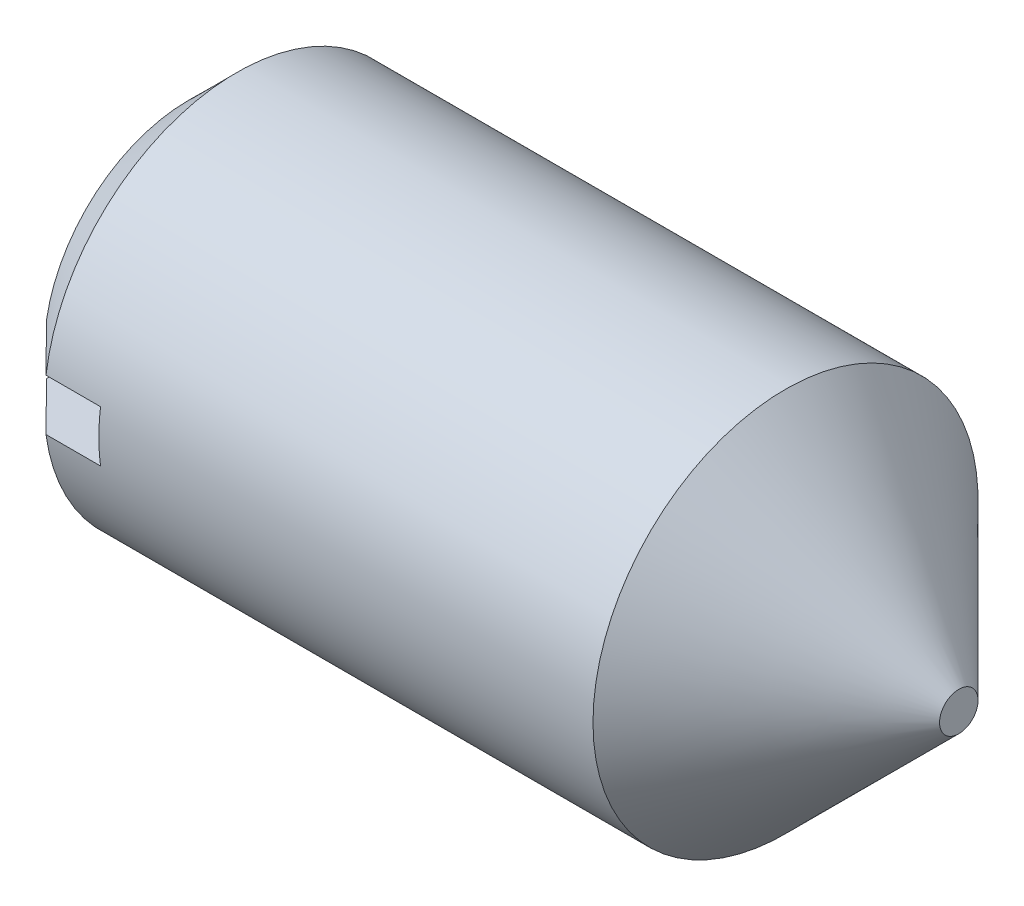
ISO-10303-21;
HEADER;
FILE_DESCRIPTION(('STEP AP214'),'2;1');
FILE_NAME('part.step','',(''),(''),'','','');
FILE_SCHEMA(('AUTOMOTIVE_DESIGN { 1 0 10303 214 1 1 1 1 }'));
ENDSEC;
DATA;
#1=APPLICATION_CONTEXT('core data for automotive mechanical design processes');
#2=APPLICATION_PROTOCOL_DEFINITION('international standard','automotive_design',2000,#1);
#3=PRODUCT_CONTEXT('',#1,'mechanical');
#4=PRODUCT('Part','Part','',(#3));
#5=PRODUCT_RELATED_PRODUCT_CATEGORY('part','',(#4));
#6=PRODUCT_DEFINITION_FORMATION('','',#4);
#7=PRODUCT_DEFINITION_CONTEXT('part definition',#1,'design');
#8=PRODUCT_DEFINITION('design','',#6,#7);
#9=PRODUCT_DEFINITION_SHAPE('','',#8);
#10=(LENGTH_UNIT() NAMED_UNIT(*) SI_UNIT(.MILLI.,.METRE.));
#11=(NAMED_UNIT(*) PLANE_ANGLE_UNIT() SI_UNIT($,.RADIAN.));
#12=(NAMED_UNIT(*) SI_UNIT($,.STERADIAN.) SOLID_ANGLE_UNIT());
#13=UNCERTAINTY_MEASURE_WITH_UNIT(LENGTH_MEASURE(1.E-05),#10,'distance_accuracy_value','');
#14=(GEOMETRIC_REPRESENTATION_CONTEXT(3) GLOBAL_UNCERTAINTY_ASSIGNED_CONTEXT((#13)) GLOBAL_UNIT_ASSIGNED_CONTEXT((#10,
#11,#12)) REPRESENTATION_CONTEXT('',''));
#15=CARTESIAN_POINT('',(0.,0.,0.));
#16=DIRECTION('',(0.,0.,1.));
#17=DIRECTION('',(1.,0.,0.));
#18=AXIS2_PLACEMENT_3D('',#15,#16,#17);
#19=CARTESIAN_POINT('',(0.,1.125,0.));
#20=DIRECTION('',(1.,0.,0.));
#21=DIRECTION('',(0.,0.,-1.));
#22=AXIS2_PLACEMENT_3D('',#19,#20,#21);
#23=PLANE('',#22);
#24=CARTESIAN_POINT('',(0.,0.,0.));
#25=DIRECTION('',(-1.,0.,0.));
#26=DIRECTION('',(0.,0.,1.));
#27=AXIS2_PLACEMENT_3D('',#24,#25,#26);
#28=CIRCLE('',#27,1.125);
#29=CARTESIAN_POINT('',(0.,0.2,1.10707949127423));
#30=VERTEX_POINT('',#29);
#31=CARTESIAN_POINT('',(0.,0.2,-1.10707949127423));
#32=VERTEX_POINT('',#31);
#33=EDGE_CURVE('E120',#30,#32,#28,.T.);
#34=ORIENTED_EDGE('',*,*,#33,.T.);
#35=DIRECTION('',(0.,0.,1.));
#36=VECTOR('',#35,1.);
#37=CARTESIAN_POINT('',(0.,0.2,-1.5));
#38=LINE('',#37,#36);
#39=EDGE_CURVE('E107',#32,#30,#38,.T.);
#40=ORIENTED_EDGE('',*,*,#39,.T.);
#41=EDGE_LOOP('',(#34,#40));
#42=FACE_BOUND('',#41,.T.);
#43=ADVANCED_FACE('F37',(#42),#23,.F.);
#44=CARTESIAN_POINT('',(0.375000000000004,0.,0.));
#45=DIRECTION('',(1.,0.,0.));
#46=DIRECTION('',(0.,0.,-1.));
#47=AXIS2_PLACEMENT_3D('',#44,#45,#46);
#48=CONICAL_SURFACE('',#47,1.5,0.785398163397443);
#49=CARTESIAN_POINT('',(0.375000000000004,0.,0.));
#50=DIRECTION('',(-1.,0.,0.));
#51=DIRECTION('',(0.,0.,1.));
#52=AXIS2_PLACEMENT_3D('',#49,#50,#51);
#53=CIRCLE('',#52,1.5);
#54=CARTESIAN_POINT('',(0.375000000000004,0.2,1.48660687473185));
#55=VERTEX_POINT('',#54);
#56=CARTESIAN_POINT('',(0.375000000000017,0.2,-1.48660687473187));
#57=VERTEX_POINT('',#56);
#58=EDGE_CURVE('E125',#55,#57,#53,.T.);
#59=ORIENTED_EDGE('',*,*,#58,.T.);
#60=CARTESIAN_POINT('',(2.18920799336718,0.2,-3.30816786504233));
#61=CARTESIAN_POINT('',(2.07649366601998,0.2,-3.19524610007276));
#62=CARTESIAN_POINT('',(1.96378832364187,0.2,-3.0823153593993));
#63=CARTESIAN_POINT('',(1.73840550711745,0.2,-2.85642283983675));
#64=CARTESIAN_POINT('',(1.62572803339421,0.2,-2.74346106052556));
#65=CARTESIAN_POINT('',(1.40037767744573,0.2,-2.51746010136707));
#66=CARTESIAN_POINT('',(1.28770480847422,0.2,-2.40442090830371));
#67=CARTESIAN_POINT('',(1.06242244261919,0.2,-2.17828252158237));
#68=CARTESIAN_POINT('',(0.949812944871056,0.2,-2.06518332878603));
#69=CARTESIAN_POINT('',(0.721578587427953,0.2,-1.83575394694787));
#70=CARTESIAN_POINT('',(0.605956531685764,0.2,-1.71942096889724));
#71=CARTESIAN_POINT('',(0.374890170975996,0.2,-1.48656880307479));
#72=CARTESIAN_POINT('',(0.259445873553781,0.2,-1.3700496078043));
#73=CARTESIAN_POINT('',(0.0865825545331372,0.2,-1.19499523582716));
#74=CARTESIAN_POINT('',(0.0290178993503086,0.2,-1.13660389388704));
#75=CARTESIAN_POINT('',(-0.0859582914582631,0.2,-1.01966845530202));
#76=CARTESIAN_POINT('',(-0.143369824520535,0.2,-0.96112435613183));
#77=CARTESIAN_POINT('',(-0.257927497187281,0.2,-0.843786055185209));
#78=CARTESIAN_POINT('',(-0.315073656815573,0.2,-0.784991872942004));
#79=CARTESIAN_POINT('',(-0.428894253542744,0.2,-0.666949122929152));
#80=CARTESIAN_POINT('',(-0.485568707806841,0.2,-0.607700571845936));
#81=CARTESIAN_POINT('',(-0.556834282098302,0.2,-0.531827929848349));
#82=CARTESIAN_POINT('',(-0.571929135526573,0.2,-0.515678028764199));
#83=CARTESIAN_POINT('',(-0.602008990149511,0.2,-0.483276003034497));
#84=CARTESIAN_POINT('',(-0.616993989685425,0.2,-0.467023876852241));
#85=CARTESIAN_POINT('',(-0.661668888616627,0.2,-0.418156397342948));
#86=CARTESIAN_POINT('',(-0.691153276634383,0.2,-0.385351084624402));
#87=CARTESIAN_POINT('',(-0.738520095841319,0.2,-0.330870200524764));
#88=CARTESIAN_POINT('',(-0.756726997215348,0.2,-0.309479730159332));
#89=CARTESIAN_POINT('',(-0.792449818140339,0.2,-0.26597934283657));
#90=CARTESIAN_POINT('',(-0.809962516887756,0.2,-0.243866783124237));
#91=CARTESIAN_POINT('',(-0.843767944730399,0.2,-0.198329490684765));
#92=CARTESIAN_POINT('',(-0.860046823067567,0.2,-0.174893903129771));
#93=CARTESIAN_POINT('',(-0.882018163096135,0.2,-0.138316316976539));
#94=CARTESIAN_POINT('',(-0.888920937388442,0.2,-0.125916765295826));
#95=CARTESIAN_POINT('',(-0.901444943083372,0.2,-0.100497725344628));
#96=CARTESIAN_POINT('',(-0.907068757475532,0.2,-0.0874795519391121));
#97=CARTESIAN_POINT('',(-0.916365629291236,0.2,-0.060703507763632));
#98=CARTESIAN_POINT('',(-0.92003589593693,0.2,-0.0469446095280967));
#99=CARTESIAN_POINT('',(-0.924561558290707,0.2,-0.0190194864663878));
#100=CARTESIAN_POINT('',(-0.925434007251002,0.2,-0.00485626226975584));
#101=CARTESIAN_POINT('',(-0.924139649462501,0.2,0.0233294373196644));
#102=CARTESIAN_POINT('',(-0.921970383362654,0.2,0.0373517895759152));
#103=CARTESIAN_POINT('',(-0.915181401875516,0.2,0.0648425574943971));
#104=CARTESIAN_POINT('',(-0.910545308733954,0.2,0.0783066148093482));
#105=CARTESIAN_POINT('',(-0.898239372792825,0.2,0.107921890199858));
#106=CARTESIAN_POINT('',(-0.890094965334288,0.2,0.123867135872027));
#107=CARTESIAN_POINT('',(-0.872331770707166,0.2,0.154929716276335));
#108=CARTESIAN_POINT('',(-0.862709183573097,0.2,0.170044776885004));
#109=CARTESIAN_POINT('',(-0.842523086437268,0.2,0.199782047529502));
#110=CARTESIAN_POINT('',(-0.831953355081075,0.2,0.214399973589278));
#111=CARTESIAN_POINT('',(-0.810271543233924,0.2,0.24319218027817));
#112=CARTESIAN_POINT('',(-0.799160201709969,0.2,0.257367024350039));
#113=CARTESIAN_POINT('',(-0.761648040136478,0.2,0.303984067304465));
#114=CARTESIAN_POINT('',(-0.734462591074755,0.2,0.335790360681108));
#115=CARTESIAN_POINT('',(-0.679232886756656,0.2,0.398651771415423));
#116=CARTESIAN_POINT('',(-0.651188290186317,0.2,0.429706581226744));
#117=CARTESIAN_POINT('',(-0.594583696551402,0.2,0.49141985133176));
#118=CARTESIAN_POINT('',(-0.566023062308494,0.2,0.522077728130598));
#119=CARTESIAN_POINT('',(-0.508622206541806,0.2,0.583118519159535));
#120=CARTESIAN_POINT('',(-0.479782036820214,0.2,0.613501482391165));
#121=CARTESIAN_POINT('',(-0.393361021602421,0.2,0.704003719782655));
#122=CARTESIAN_POINT('',(-0.335513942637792,0.2,0.763868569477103));
#123=CARTESIAN_POINT('',(-0.219518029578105,0.2,0.883224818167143));
#124=CARTESIAN_POINT('',(-0.161369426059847,0.2,0.942716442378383));
#125=CARTESIAN_POINT('',(-0.00876825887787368,0.2,1.09833366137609));
#126=CARTESIAN_POINT('',(0.0858416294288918,0.2,1.19430497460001));
#127=CARTESIAN_POINT('',(0.275298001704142,0.2,1.38601480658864));
#128=CARTESIAN_POINT('',(0.370144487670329,0.2,1.48175332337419));
#129=CARTESIAN_POINT('',(0.654937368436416,0.2,1.76883520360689));
#130=CARTESIAN_POINT('',(0.84507847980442,0.2,1.95998539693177));
#131=CARTESIAN_POINT('',(1.22752139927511,0.2,2.34406726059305));
#132=CARTESIAN_POINT('',(1.41982522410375,0.2,2.53699691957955));
#133=CARTESIAN_POINT('',(1.80448365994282,0.2,2.92267869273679));
#134=CARTESIAN_POINT('',(1.99683823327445,0.2,3.11543084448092));
#135=CARTESIAN_POINT('',(2.18920799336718,0.2,3.30816786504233));
#136=B_SPLINE_CURVE_WITH_KNOTS('',3,(#60,#61,#62,#63,#64,#65,#66,#67,#68,#69,#70,#71,#72,#73,
#74,#75,#76,#77,#78,#79,#80,#81,#82,#83,#84,#85,#86,#87,#88,#89,#90,#91,#92,#93,#94,#95,#96,#97,
#98,#99,#100,#101,#102,#103,#104,#105,#106,#107,#108,#109,#110,#111,#112,#113,#114,#115,#116,
#117,#118,#119,#120,#121,#122,#123,#124,#125,#126,#127,#128,#129,#130,#131,#132,#133,#134,#135),
.UNSPECIFIED.,.F.,.F.,(4,2,2,2,2,2,2,2,2,2,2,2,2,2,2,2,2,2,2,2,2,2,2,2,2,2,2,2,2,2,2,2,2,2,2,2,
2,4),(0.,0.478646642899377,0.957300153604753,1.43610836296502,1.91490987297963,2.40696308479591,
2.89903663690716,3.14502260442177,3.39101266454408,3.63698385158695,3.88294604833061,
3.94926343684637,4.01558182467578,4.14789298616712,4.23214940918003,4.31675946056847,
4.40221020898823,4.44473908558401,4.48718129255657,4.52968396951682,4.57192708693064,
4.61420437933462,4.6567659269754,4.71033863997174,4.76405145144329,4.81814735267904,
4.87217140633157,4.99764955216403,5.12317821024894,5.24887419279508,5.37454731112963,
5.62428482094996,5.87385340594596,6.278146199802,6.68244241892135,7.49128561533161,
8.30849034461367,9.12542549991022),.UNSPECIFIED.);
#137=EDGE_CURVE('E60',#57,#32,#136,.T.);
#138=ORIENTED_EDGE('',*,*,#137,.T.);
#139=ORIENTED_EDGE('',*,*,#33,.F.);
#140=EDGE_CURVE('E140',#30,#55,#136,.T.);
#141=ORIENTED_EDGE('',*,*,#140,.T.);
#142=EDGE_LOOP('',(#59,#138,#139,#141));
#143=FACE_BOUND('',#142,.T.);
#144=ADVANCED_FACE('F159',(#143),#48,.T.);
#145=CARTESIAN_POINT('',(0.,-0.2,-1.10707949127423));
#146=VERTEX_POINT('',#145);
#147=CARTESIAN_POINT('',(0.,-0.2,1.10707949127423));
#148=VERTEX_POINT('',#147);
#149=EDGE_CURVE('E119',#146,#148,#28,.T.);
#150=ORIENTED_EDGE('',*,*,#149,.T.);
#151=DIRECTION('',(0.,0.,1.));
#152=VECTOR('',#151,1.);
#153=CARTESIAN_POINT('',(0.,-0.2,-1.5));
#154=LINE('',#153,#152);
#155=EDGE_CURVE('E100',#146,#148,#154,.T.);
#156=ORIENTED_EDGE('',*,*,#155,.F.);
#157=EDGE_LOOP('',(#150,#156));
#158=FACE_BOUND('',#157,.T.);
#159=ADVANCED_FACE('F39',(#158),#23,.F.);
#160=CARTESIAN_POINT('',(6.,0.,0.));
#161=DIRECTION('',(-1.,0.,0.));
#162=DIRECTION('',(0.,0.,1.));
#163=AXIS2_PLACEMENT_3D('',#160,#161,#162);
#164=PLANE('',#163);
#165=CARTESIAN_POINT('',(6.,0.,0.));
#166=DIRECTION('',(-1.,0.,0.));
#167=DIRECTION('',(0.,0.,1.));
#168=AXIS2_PLACEMENT_3D('',#165,#166,#167);
#169=CIRCLE('',#168,0.15);
#170=CARTESIAN_POINT('',(6.,0.,0.15));
#171=VERTEX_POINT('',#170);
#172=EDGE_CURVE('E129',#171,#171,#169,.T.);
#173=ORIENTED_EDGE('',*,*,#172,.F.);
#174=EDGE_LOOP('',(#173));
#175=FACE_BOUND('',#174,.T.);
#176=ADVANCED_FACE('F166',(#175),#164,.F.);
#177=CARTESIAN_POINT('',(6.,0.,0.));
#178=DIRECTION('',(-1.,0.,0.));
#179=DIRECTION('',(0.,0.,1.));
#180=AXIS2_PLACEMENT_3D('',#177,#178,#179);
#181=CONICAL_SURFACE('',#180,0.15,0.785398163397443);
#182=CARTESIAN_POINT('',(4.64999999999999,0.,0.));
#183=DIRECTION('',(-1.,0.,0.));
#184=DIRECTION('',(0.,0.,1.));
#185=AXIS2_PLACEMENT_3D('',#182,#183,#184);
#186=CIRCLE('',#185,1.5);
#187=CARTESIAN_POINT('',(4.64999999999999,0.,1.5));
#188=VERTEX_POINT('',#187);
#189=EDGE_CURVE('E126',#188,#188,#186,.T.);
#190=CARTESIAN_POINT('',(4.64999999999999,0.,1.5));
#191=CARTESIAN_POINT('',(4.66406249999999,0.,1.4859375));
#192=CARTESIAN_POINT('',(4.67812499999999,0.,1.471875));
#193=CARTESIAN_POINT('',(4.70624999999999,0.,1.44375));
#194=CARTESIAN_POINT('',(4.72031249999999,0.,1.4296875));
#195=CARTESIAN_POINT('',(4.74843749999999,0.,1.4015625));
#196=CARTESIAN_POINT('',(4.76249999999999,0.,1.3875));
#197=CARTESIAN_POINT('',(4.79062499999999,0.,1.359375));
#198=CARTESIAN_POINT('',(4.80468749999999,0.,1.3453125));
#199=CARTESIAN_POINT('',(4.83281249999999,0.,1.3171875));
#200=CARTESIAN_POINT('',(4.84687499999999,0.,1.303125));
#201=CARTESIAN_POINT('',(4.87499999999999,0.,1.275));
#202=CARTESIAN_POINT('',(4.88906249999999,0.,1.2609375));
#203=CARTESIAN_POINT('',(4.91718749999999,0.,1.2328125));
#204=CARTESIAN_POINT('',(4.93124999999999,0.,1.21875));
#205=CARTESIAN_POINT('',(4.95937499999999,0.,1.190625));
#206=CARTESIAN_POINT('',(4.97343749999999,0.,1.1765625));
#207=CARTESIAN_POINT('',(5.00156249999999,0.,1.1484375));
#208=CARTESIAN_POINT('',(5.01562499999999,0.,1.134375));
#209=CARTESIAN_POINT('',(5.04374999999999,0.,1.10625));
#210=CARTESIAN_POINT('',(5.05781249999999,0.,1.0921875));
#211=CARTESIAN_POINT('',(5.08593749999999,0.,1.0640625));
#212=CARTESIAN_POINT('',(5.09999999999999,0.,1.05));
#213=CARTESIAN_POINT('',(5.12812499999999,0.,1.021875));
#214=CARTESIAN_POINT('',(5.14218749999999,0.,1.0078125));
#215=CARTESIAN_POINT('',(5.17031249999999,0.,0.9796875));
#216=CARTESIAN_POINT('',(5.18437499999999,0.,0.965625));
#217=CARTESIAN_POINT('',(5.21249999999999,0.,0.9375));
#218=CARTESIAN_POINT('',(5.22656249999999,0.,0.9234375));
#219=CARTESIAN_POINT('',(5.25468749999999,0.,0.8953125));
#220=CARTESIAN_POINT('',(5.26874999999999,0.,0.88125));
#221=CARTESIAN_POINT('',(5.29687499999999,0.,0.853125));
#222=CARTESIAN_POINT('',(5.31093749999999,0.,0.839062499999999));
#223=CARTESIAN_POINT('',(5.33906249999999,0.,0.8109375));
#224=CARTESIAN_POINT('',(5.35312499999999,0.,0.796875));
#225=CARTESIAN_POINT('',(5.38124999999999,0.,0.76875));
#226=CARTESIAN_POINT('',(5.39531249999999,0.,0.7546875));
#227=CARTESIAN_POINT('',(5.42343749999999,0.,0.7265625));
#228=CARTESIAN_POINT('',(5.43749999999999,0.,0.7125));
#229=CARTESIAN_POINT('',(5.46562499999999,0.,0.684375));
#230=CARTESIAN_POINT('',(5.4796875,0.,0.6703125));
#231=CARTESIAN_POINT('',(5.5078125,0.,0.6421875));
#232=CARTESIAN_POINT('',(5.521875,0.,0.628125));
#233=CARTESIAN_POINT('',(5.55,0.,0.6));
#234=CARTESIAN_POINT('',(5.5640625,0.,0.5859375));
#235=CARTESIAN_POINT('',(5.5921875,0.,0.5578125));
#236=CARTESIAN_POINT('',(5.60625,0.,0.54375));
#237=CARTESIAN_POINT('',(5.634375,0.,0.515625));
#238=CARTESIAN_POINT('',(5.6484375,0.,0.501562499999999));
#239=CARTESIAN_POINT('',(5.6765625,0.,0.4734375));
#240=CARTESIAN_POINT('',(5.690625,0.,0.459375));
#241=CARTESIAN_POINT('',(5.71875,0.,0.43125));
#242=CARTESIAN_POINT('',(5.7328125,0.,0.4171875));
#243=CARTESIAN_POINT('',(5.7609375,0.,0.3890625));
#244=CARTESIAN_POINT('',(5.775,0.,0.375));
#245=CARTESIAN_POINT('',(5.803125,0.,0.346875));
#246=CARTESIAN_POINT('',(5.8171875,0.,0.3328125));
#247=CARTESIAN_POINT('',(5.8453125,0.,0.3046875));
#248=CARTESIAN_POINT('',(5.859375,0.,0.290624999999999));
#249=CARTESIAN_POINT('',(5.8875,0.,0.2625));
#250=CARTESIAN_POINT('',(5.9015625,0.,0.2484375));
#251=CARTESIAN_POINT('',(5.9296875,0.,0.2203125));
#252=CARTESIAN_POINT('',(5.94375,0.,0.20625));
#253=CARTESIAN_POINT('',(5.971875,0.,0.178124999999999));
#254=CARTESIAN_POINT('',(5.9859375,0.,0.164062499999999));
#255=CARTESIAN_POINT('',(6.,0.,0.15));
#256=B_SPLINE_CURVE_WITH_KNOTS('',3,(#190,#191,#192,#193,#194,#195,#196,#197,#198,#199,#200,
#201,#202,#203,#204,#205,#206,#207,#208,#209,#210,#211,#212,#213,#214,#215,#216,#217,#218,#219,
#220,#221,#222,#223,#224,#225,#226,#227,#228,#229,#230,#231,#232,#233,#234,#235,#236,#237,#238,
#239,#240,#241,#242,#243,#244,#245,#246,#247,#248,#249,#250,#251,#252,#253,#254,#255),
.UNSPECIFIED.,.F.,.F.,(4,2,2,2,2,2,2,2,2,2,2,2,2,2,2,2,2,2,2,2,2,2,2,2,2,2,2,2,2,2,2,2,4),(0.,
0.0596621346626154,0.119324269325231,0.178986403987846,0.238648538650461,0.298310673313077,
0.357972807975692,0.417634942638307,0.477297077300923,0.536959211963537,0.596621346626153,
0.656283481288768,0.715945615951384,0.775607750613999,0.835269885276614,0.89493201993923,
0.954594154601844,1.01425628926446,1.07391842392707,1.13358055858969,1.19324269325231,
1.25290482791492,1.31256696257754,1.37222909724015,1.43189123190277,1.49155336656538,
1.551215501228,1.61087763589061,1.67053977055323,1.73020190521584,1.78986403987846,
1.84952617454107,1.90918830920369),.UNSPECIFIED.);
#257=EDGE_CURVE('BSEAM171',#188,#171,#256,.T.);
#258=ORIENTED_EDGE('',*,*,#189,.F.);
#259=ORIENTED_EDGE('',*,*,#172,.T.);
#260=ORIENTED_EDGE('',*,*,#257,.T.);
#261=ORIENTED_EDGE('',*,*,#257,.F.);
#262=EDGE_LOOP('',(#258,#260,#259,#261));
#263=FACE_BOUND('',#262,.T.);
#264=ADVANCED_FACE('F171',(#263),#181,.T.);
#265=CARTESIAN_POINT('',(-14.774129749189,0.,0.));
#266=DIRECTION('',(-1.,0.,0.));
#267=DIRECTION('',(0.,0.,1.));
#268=AXIS2_PLACEMENT_3D('',#265,#266,#267);
#269=CYLINDRICAL_SURFACE('',#268,1.5);
#270=CARTESIAN_POINT('',(0.8,0.,0.));
#271=DIRECTION('',(1.,0.,0.));
#272=DIRECTION('',(0.,0.,-1.));
#273=AXIS2_PLACEMENT_3D('',#270,#271,#272);
#274=CIRCLE('',#273,1.5);
#275=CARTESIAN_POINT('',(0.8,-0.2,-1.48660687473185));
#276=VERTEX_POINT('',#275);
#277=CARTESIAN_POINT('',(0.8,0.2,-1.48660687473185));
#278=VERTEX_POINT('',#277);
#279=EDGE_CURVE('E11',#276,#278,#274,.T.);
#280=ORIENTED_EDGE('',*,*,#279,.T.);
#281=DIRECTION('',(-1.,0.,0.));
#282=VECTOR('',#281,1.);
#283=CARTESIAN_POINT('',(-14.774129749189,0.2,-1.48660687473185));
#284=LINE('',#283,#282);
#285=EDGE_CURVE('E117',#278,#57,#284,.T.);
#286=ORIENTED_EDGE('',*,*,#285,.T.);
#287=ORIENTED_EDGE('',*,*,#58,.F.);
#288=DIRECTION('',(-1.,0.,0.));
#289=VECTOR('',#288,1.);
#290=CARTESIAN_POINT('',(-14.774129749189,0.2,1.48660687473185));
#291=LINE('',#290,#289);
#292=CARTESIAN_POINT('',(0.8,0.2,1.48660687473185));
#293=VERTEX_POINT('',#292);
#294=EDGE_CURVE('E109',#55,#293,#291,.F.);
#295=ORIENTED_EDGE('',*,*,#294,.T.);
#296=CARTESIAN_POINT('',(0.8,-0.2,1.48660687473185));
#297=VERTEX_POINT('',#296);
#298=EDGE_CURVE('E41',#293,#297,#274,.T.);
#299=ORIENTED_EDGE('',*,*,#298,.T.);
#300=DIRECTION('',(-1.,0.,0.));
#301=VECTOR('',#300,1.);
#302=CARTESIAN_POINT('',(-14.774129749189,-0.2,1.48660687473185));
#303=LINE('',#302,#301);
#304=CARTESIAN_POINT('',(0.375000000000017,-0.2,1.48660687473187));
#305=VERTEX_POINT('',#304);
#306=EDGE_CURVE('E99',#297,#305,#303,.T.);
#307=ORIENTED_EDGE('',*,*,#306,.T.);
#308=CARTESIAN_POINT('',(0.375000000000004,-0.2,-1.48660687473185));
#309=VERTEX_POINT('',#308);
#310=EDGE_CURVE('E106',#309,#305,#53,.T.);
#311=ORIENTED_EDGE('',*,*,#310,.F.);
#312=DIRECTION('',(-1.,0.,0.));
#313=VECTOR('',#312,1.);
#314=CARTESIAN_POINT('',(-14.774129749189,-0.2,-1.48660687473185));
#315=LINE('',#314,#313);
#316=EDGE_CURVE('E52',#309,#276,#315,.F.);
#317=ORIENTED_EDGE('',*,*,#316,.T.);
#318=EDGE_LOOP('',(#280,#286,#287,#295,#299,#307,#311,#317));
#319=FACE_BOUND('',#318,.T.);
#320=ORIENTED_EDGE('',*,*,#189,.T.);
#321=EDGE_LOOP('',(#320));
#322=FACE_BOUND('',#321,.T.);
#323=ADVANCED_FACE('F103',(#319,#322),#269,.T.);
#324=ORIENTED_EDGE('',*,*,#310,.T.);
#325=CARTESIAN_POINT('',(2.18920799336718,-0.2,3.30816786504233));
#326=CARTESIAN_POINT('',(2.07649366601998,-0.2,3.19524610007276));
#327=CARTESIAN_POINT('',(1.96378832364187,-0.2,3.0823153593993));
#328=CARTESIAN_POINT('',(1.73840550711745,-0.2,2.85642283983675));
#329=CARTESIAN_POINT('',(1.6257280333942,-0.2,2.74346106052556));
#330=CARTESIAN_POINT('',(1.40037767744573,-0.2,2.51746010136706));
#331=CARTESIAN_POINT('',(1.28770480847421,-0.2,2.40442090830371));
#332=CARTESIAN_POINT('',(1.06242244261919,-0.2,2.17828252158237));
#333=CARTESIAN_POINT('',(0.94981294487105,-0.2,2.06518332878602));
#334=CARTESIAN_POINT('',(0.721578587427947,-0.2,1.83575394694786));
#335=CARTESIAN_POINT('',(0.605956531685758,-0.2,1.71942096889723));
#336=CARTESIAN_POINT('',(0.374890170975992,-0.2,1.48656880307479));
#337=CARTESIAN_POINT('',(0.259445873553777,-0.2,1.3700496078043));
#338=CARTESIAN_POINT('',(0.0865825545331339,-0.2,1.19499523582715));
#339=CARTESIAN_POINT('',(0.0290178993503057,-0.2,1.13660389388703));
#340=CARTESIAN_POINT('',(-0.0859582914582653,-0.2,1.01966845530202));
#341=CARTESIAN_POINT('',(-0.143369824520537,-0.2,0.961124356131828));
#342=CARTESIAN_POINT('',(-0.257927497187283,-0.2,0.843786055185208));
#343=CARTESIAN_POINT('',(-0.315073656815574,-0.2,0.784991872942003));
#344=CARTESIAN_POINT('',(-0.428894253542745,-0.2,0.666949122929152));
#345=CARTESIAN_POINT('',(-0.485568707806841,-0.2,0.607700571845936));
#346=CARTESIAN_POINT('',(-0.556834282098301,-0.2,0.53182792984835));
#347=CARTESIAN_POINT('',(-0.571929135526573,-0.2,0.515678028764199));
#348=CARTESIAN_POINT('',(-0.602008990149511,-0.2,0.483276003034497));
#349=CARTESIAN_POINT('',(-0.616993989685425,-0.2,0.467023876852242));
#350=CARTESIAN_POINT('',(-0.661668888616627,-0.2,0.418156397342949));
#351=CARTESIAN_POINT('',(-0.691153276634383,-0.2,0.385351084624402));
#352=CARTESIAN_POINT('',(-0.738520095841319,-0.2,0.330870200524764));
#353=CARTESIAN_POINT('',(-0.756726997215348,-0.2,0.309479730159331));
#354=CARTESIAN_POINT('',(-0.792449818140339,-0.2,0.26597934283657));
#355=CARTESIAN_POINT('',(-0.809962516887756,-0.2,0.243866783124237));
#356=CARTESIAN_POINT('',(-0.843767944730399,-0.2,0.198329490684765));
#357=CARTESIAN_POINT('',(-0.860046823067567,-0.2,0.174893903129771));
#358=CARTESIAN_POINT('',(-0.882018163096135,-0.2,0.138316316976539));
#359=CARTESIAN_POINT('',(-0.888920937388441,-0.2,0.125916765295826));
#360=CARTESIAN_POINT('',(-0.901444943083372,-0.2,0.100497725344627));
#361=CARTESIAN_POINT('',(-0.907068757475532,-0.2,0.087479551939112));
#362=CARTESIAN_POINT('',(-0.916365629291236,-0.2,0.0607035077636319));
#363=CARTESIAN_POINT('',(-0.920035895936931,-0.2,0.0469446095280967));
#364=CARTESIAN_POINT('',(-0.924561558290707,-0.2,0.0190194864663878));
#365=CARTESIAN_POINT('',(-0.925434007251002,-0.2,0.00485626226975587));
#366=CARTESIAN_POINT('',(-0.924139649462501,-0.2,-0.0233294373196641));
#367=CARTESIAN_POINT('',(-0.921970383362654,-0.2,-0.0373517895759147));
#368=CARTESIAN_POINT('',(-0.915181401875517,-0.2,-0.0648425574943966));
#369=CARTESIAN_POINT('',(-0.910545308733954,-0.2,-0.0783066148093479));
#370=CARTESIAN_POINT('',(-0.898239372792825,-0.2,-0.107921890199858));
#371=CARTESIAN_POINT('',(-0.890094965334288,-0.2,-0.123867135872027));
#372=CARTESIAN_POINT('',(-0.872331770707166,-0.2,-0.154929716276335));
#373=CARTESIAN_POINT('',(-0.862709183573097,-0.2,-0.170044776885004));
#374=CARTESIAN_POINT('',(-0.842523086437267,-0.2,-0.199782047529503));
#375=CARTESIAN_POINT('',(-0.831953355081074,-0.2,-0.214399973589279));
#376=CARTESIAN_POINT('',(-0.810271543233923,-0.2,-0.243192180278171));
#377=CARTESIAN_POINT('',(-0.799160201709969,-0.2,-0.257367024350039));
#378=CARTESIAN_POINT('',(-0.761648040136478,-0.2,-0.303984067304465));
#379=CARTESIAN_POINT('',(-0.734462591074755,-0.2,-0.335790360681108));
#380=CARTESIAN_POINT('',(-0.679232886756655,-0.2,-0.398651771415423));
#381=CARTESIAN_POINT('',(-0.651188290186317,-0.2,-0.429706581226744));
#382=CARTESIAN_POINT('',(-0.594583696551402,-0.2,-0.49141985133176));
#383=CARTESIAN_POINT('',(-0.566023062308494,-0.2,-0.522077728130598));
#384=CARTESIAN_POINT('',(-0.508622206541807,-0.2,-0.583118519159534));
#385=CARTESIAN_POINT('',(-0.479782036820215,-0.2,-0.613501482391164));
#386=CARTESIAN_POINT('',(-0.393361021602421,-0.2,-0.704003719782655));
#387=CARTESIAN_POINT('',(-0.335513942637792,-0.2,-0.763868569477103));
#388=CARTESIAN_POINT('',(-0.219518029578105,-0.2,-0.883224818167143));
#389=CARTESIAN_POINT('',(-0.161369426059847,-0.2,-0.942716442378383));
#390=CARTESIAN_POINT('',(-0.0087682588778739,-0.2,-1.09833366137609));
#391=CARTESIAN_POINT('',(0.0858416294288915,-0.2,-1.19430497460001));
#392=CARTESIAN_POINT('',(0.275298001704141,-0.2,-1.38601480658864));
#393=CARTESIAN_POINT('',(0.370144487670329,-0.2,-1.48175332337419));
#394=CARTESIAN_POINT('',(0.654937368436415,-0.2,-1.76883520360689));
#395=CARTESIAN_POINT('',(0.845078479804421,-0.2,-1.95998539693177));
#396=CARTESIAN_POINT('',(1.22752139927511,-0.2,-2.34406726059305));
#397=CARTESIAN_POINT('',(1.41982522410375,-0.2,-2.53699691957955));
#398=CARTESIAN_POINT('',(1.80448365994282,-0.2,-2.92267869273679));
#399=CARTESIAN_POINT('',(1.99683823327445,-0.2,-3.11543084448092));
#400=CARTESIAN_POINT('',(2.18920799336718,-0.2,-3.30816786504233));
#401=B_SPLINE_CURVE_WITH_KNOTS('',3,(#325,#326,#327,#328,#329,#330,#331,#332,#333,#334,#335,
#336,#337,#338,#339,#340,#341,#342,#343,#344,#345,#346,#347,#348,#349,#350,#351,#352,#353,#354,
#355,#356,#357,#358,#359,#360,#361,#362,#363,#364,#365,#366,#367,#368,#369,#370,#371,#372,#373,
#374,#375,#376,#377,#378,#379,#380,#381,#382,#383,#384,#385,#386,#387,#388,#389,#390,#391,#392,
#393,#394,#395,#396,#397,#398,#399,#400),.UNSPECIFIED.,.F.,.F.,(4,2,2,2,2,2,2,2,2,2,2,2,2,2,2,2,
2,2,2,2,2,2,2,2,2,2,2,2,2,2,2,2,2,2,2,2,2,4),(0.,0.478646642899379,0.957300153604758,
1.43610836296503,1.91490987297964,2.40696308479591,2.89903663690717,3.14502260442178,
3.39101266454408,3.63698385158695,3.88294604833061,3.94926343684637,4.01558182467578,
4.14789298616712,4.23214940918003,4.31675946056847,4.40221020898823,4.44473908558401,
4.48718129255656,4.52968396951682,4.57192708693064,4.61420437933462,4.6567659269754,
4.71033863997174,4.76405145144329,4.81814735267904,4.87217140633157,4.99764955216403,
5.12317821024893,5.24887419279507,5.37454731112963,5.62428482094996,5.87385340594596,
6.27814619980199,6.68244241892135,7.49128561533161,8.30849034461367,9.12542549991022),.UNSPECIFIED.);
#402=EDGE_CURVE('E139',#305,#148,#401,.T.);
#403=ORIENTED_EDGE('',*,*,#402,.T.);
#404=ORIENTED_EDGE('',*,*,#149,.F.);
#405=EDGE_CURVE('E132',#146,#309,#401,.T.);
#406=ORIENTED_EDGE('',*,*,#405,.T.);
#407=EDGE_LOOP('',(#324,#403,#404,#406));
#408=FACE_BOUND('',#407,.T.);
#409=ADVANCED_FACE('F146',(#408),#48,.T.);
#410=CARTESIAN_POINT('',(0.8,0.2,-1.5));
#411=DIRECTION('',(1.,0.,0.));
#412=DIRECTION('',(0.,0.,-1.));
#413=AXIS2_PLACEMENT_3D('',#410,#411,#412);
#414=PLANE('',#413);
#415=DIRECTION('',(0.,0.,1.));
#416=VECTOR('',#415,1.);
#417=CARTESIAN_POINT('',(0.8,0.2,-1.5));
#418=LINE('',#417,#416);
#419=EDGE_CURVE('E95',#278,#293,#418,.T.);
#420=ORIENTED_EDGE('',*,*,#419,.F.);
#421=ORIENTED_EDGE('',*,*,#279,.F.);
#422=DIRECTION('',(0.,0.,1.));
#423=VECTOR('',#422,1.);
#424=CARTESIAN_POINT('',(0.8,-0.2,-1.5));
#425=LINE('',#424,#423);
#426=EDGE_CURVE('E92',#276,#297,#425,.T.);
#427=ORIENTED_EDGE('',*,*,#426,.T.);
#428=ORIENTED_EDGE('',*,*,#298,.F.);
#429=EDGE_LOOP('',(#420,#421,#427,#428));
#430=FACE_BOUND('',#429,.T.);
#431=ADVANCED_FACE('F91',(#430),#414,.F.);
#432=CARTESIAN_POINT('',(0.,0.2,-1.5));
#433=DIRECTION('',(0.,1.,0.));
#434=DIRECTION('',(0.,0.,1.));
#435=AXIS2_PLACEMENT_3D('',#432,#433,#434);
#436=PLANE('',#435);
#437=ORIENTED_EDGE('',*,*,#419,.T.);
#438=ORIENTED_EDGE('',*,*,#294,.F.);
#439=ORIENTED_EDGE('',*,*,#140,.F.);
#440=ORIENTED_EDGE('',*,*,#39,.F.);
#441=ORIENTED_EDGE('',*,*,#137,.F.);
#442=ORIENTED_EDGE('',*,*,#285,.F.);
#443=EDGE_LOOP('',(#437,#438,#439,#440,#441,#442));
#444=FACE_BOUND('',#443,.T.);
#445=ADVANCED_FACE('F152',(#444),#436,.F.);
#446=CARTESIAN_POINT('',(0.,-0.2,-1.5));
#447=DIRECTION('',(0.,-1.,0.));
#448=DIRECTION('',(0.,0.,-1.));
#449=AXIS2_PLACEMENT_3D('',#446,#447,#448);
#450=PLANE('',#449);
#451=ORIENTED_EDGE('',*,*,#426,.F.);
#452=ORIENTED_EDGE('',*,*,#316,.F.);
#453=ORIENTED_EDGE('',*,*,#405,.F.);
#454=ORIENTED_EDGE('',*,*,#155,.T.);
#455=ORIENTED_EDGE('',*,*,#402,.F.);
#456=ORIENTED_EDGE('',*,*,#306,.F.);
#457=EDGE_LOOP('',(#451,#452,#453,#454,#455,#456));
#458=FACE_BOUND('',#457,.T.);
#459=ADVANCED_FACE('F97',(#458),#450,.F.);
#460=CLOSED_SHELL('',(#43,#144,#159,#176,#264,#323,#409,#431,#445,#459));
#461=MANIFOLD_SOLID_BREP('B2',#460);
#462=ADVANCED_BREP_SHAPE_REPRESENTATION('',(#18,#461),#14);
#463=SHAPE_DEFINITION_REPRESENTATION(#9,#462);
ENDSEC;
END-ISO-10303-21;
